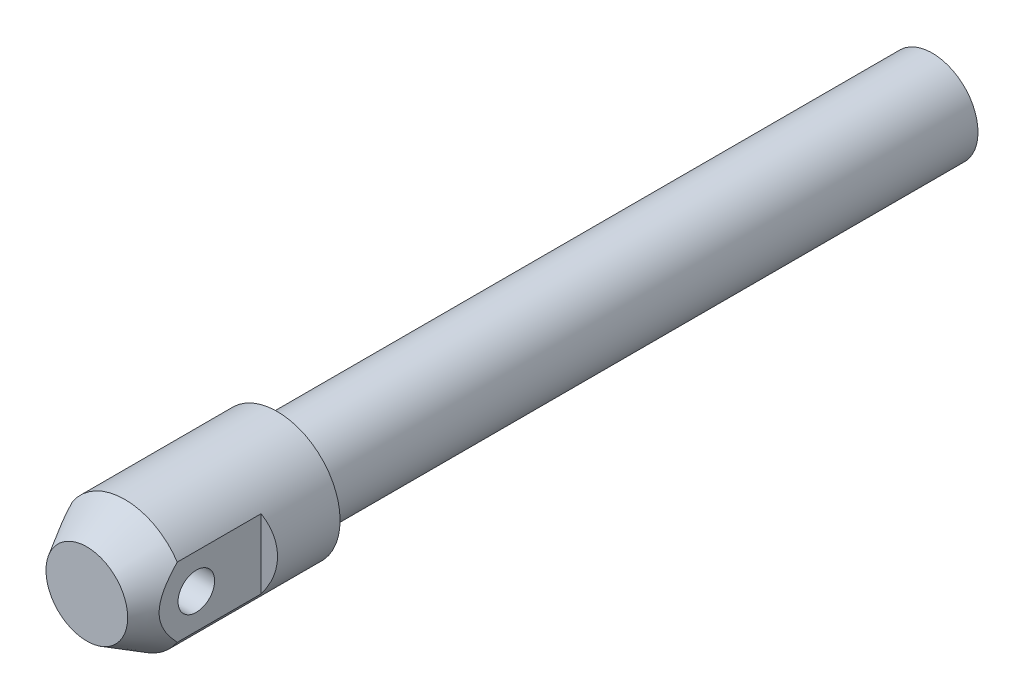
ISO-10303-21;
HEADER;
FILE_DESCRIPTION(('STEP AP214'),'2;1');
FILE_NAME('part.step','',(''),(''),'','','');
FILE_SCHEMA(('AUTOMOTIVE_DESIGN { 1 0 10303 214 1 1 1 1 }'));
ENDSEC;
DATA;
#1=APPLICATION_CONTEXT('core data for automotive mechanical design processes');
#2=APPLICATION_PROTOCOL_DEFINITION('international standard','automotive_design',2000,#1);
#3=PRODUCT_CONTEXT('',#1,'mechanical');
#4=PRODUCT('Part','Part','',(#3));
#5=PRODUCT_RELATED_PRODUCT_CATEGORY('part','',(#4));
#6=PRODUCT_DEFINITION_FORMATION('','',#4);
#7=PRODUCT_DEFINITION_CONTEXT('part definition',#1,'design');
#8=PRODUCT_DEFINITION('design','',#6,#7);
#9=PRODUCT_DEFINITION_SHAPE('','',#8);
#10=(LENGTH_UNIT() NAMED_UNIT(*) SI_UNIT(.MILLI.,.METRE.));
#11=(NAMED_UNIT(*) PLANE_ANGLE_UNIT() SI_UNIT($,.RADIAN.));
#12=(NAMED_UNIT(*) SI_UNIT($,.STERADIAN.) SOLID_ANGLE_UNIT());
#13=UNCERTAINTY_MEASURE_WITH_UNIT(LENGTH_MEASURE(1.E-05),#10,'distance_accuracy_value','');
#14=(GEOMETRIC_REPRESENTATION_CONTEXT(3) GLOBAL_UNCERTAINTY_ASSIGNED_CONTEXT((#13)) GLOBAL_UNIT_ASSIGNED_CONTEXT((#10,
#11,#12)) REPRESENTATION_CONTEXT('',''));
#15=CARTESIAN_POINT('',(0.,0.,0.));
#16=DIRECTION('',(0.,0.,1.));
#17=DIRECTION('',(1.,0.,0.));
#18=AXIS2_PLACEMENT_3D('',#15,#16,#17);
#19=CARTESIAN_POINT('',(0.,0.,20.));
#20=DIRECTION('',(0.,0.,1.));
#21=DIRECTION('',(1.,0.,0.));
#22=AXIS2_PLACEMENT_3D('',#19,#20,#21);
#23=CYLINDRICAL_SURFACE('',#22,16.5);
#24=CARTESIAN_POINT('',(0.,0.,0.));
#25=DIRECTION('',(0.,0.,1.));
#26=DIRECTION('',(1.,0.,0.));
#27=AXIS2_PLACEMENT_3D('',#24,#25,#26);
#28=CIRCLE('',#27,16.5);
#29=CARTESIAN_POINT('',(16.5,0.,0.));
#30=VERTEX_POINT('',#29);
#31=EDGE_CURVE('E82',#30,#30,#28,.T.);
#32=ORIENTED_EDGE('',*,*,#31,.T.);
#33=EDGE_LOOP('',(#32));
#34=FACE_BOUND('',#33,.T.);
#35=CARTESIAN_POINT('',(0.,0.,40.));
#36=DIRECTION('',(0.,0.,1.));
#37=DIRECTION('',(1.,0.,0.));
#38=AXIS2_PLACEMENT_3D('',#35,#36,#37);
#39=CIRCLE('',#38,16.5);
#40=CARTESIAN_POINT('',(-13.75,-9.12071817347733,40.));
#41=VERTEX_POINT('',#40);
#42=CARTESIAN_POINT('',(13.75,-9.12071817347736,40.));
#43=VERTEX_POINT('',#42);
#44=EDGE_CURVE('E67',#41,#43,#39,.T.);
#45=ORIENTED_EDGE('',*,*,#44,.F.);
#46=DIRECTION('',(0.,0.,1.));
#47=VECTOR('',#46,1.);
#48=CARTESIAN_POINT('',(-13.75,-9.12071817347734,20.));
#49=LINE('',#48,#47);
#50=CARTESIAN_POINT('',(-13.75,-9.12071817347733,18.));
#51=VERTEX_POINT('',#50);
#52=EDGE_CURVE('E30',#41,#51,#49,.F.);
#53=ORIENTED_EDGE('',*,*,#52,.T.);
#54=CARTESIAN_POINT('',(0.,0.,25.9385662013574));
#55=DIRECTION('',(0.5,0.,-0.866025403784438));
#56=DIRECTION('',(0.866025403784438,0.,0.5));
#57=AXIS2_PLACEMENT_3D('',#54,#55,#56);
#58=ELLIPSE('',#57,19.0525588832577,16.5);
#59=CARTESIAN_POINT('',(-13.75,9.12071817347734,18.));
#60=VERTEX_POINT('',#59);
#61=EDGE_CURVE('E9',#60,#51,#58,.F.);
#62=ORIENTED_EDGE('',*,*,#61,.F.);
#63=DIRECTION('',(0.,0.,1.));
#64=VECTOR('',#63,1.);
#65=CARTESIAN_POINT('',(-13.75,9.12071817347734,20.));
#66=LINE('',#65,#64);
#67=CARTESIAN_POINT('',(-13.75,9.12071817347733,40.));
#68=VERTEX_POINT('',#67);
#69=EDGE_CURVE('E63',#60,#68,#66,.T.);
#70=ORIENTED_EDGE('',*,*,#69,.T.);
#71=CARTESIAN_POINT('',(13.75,9.12071817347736,40.));
#72=VERTEX_POINT('',#71);
#73=EDGE_CURVE('E79',#72,#68,#39,.T.);
#74=ORIENTED_EDGE('',*,*,#73,.F.);
#75=DIRECTION('',(0.,0.,1.));
#76=VECTOR('',#75,1.);
#77=CARTESIAN_POINT('',(13.75,9.12071817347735,20.));
#78=LINE('',#77,#76);
#79=CARTESIAN_POINT('',(13.75,9.12071817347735,18.));
#80=VERTEX_POINT('',#79);
#81=EDGE_CURVE('E38',#80,#72,#78,.T.);
#82=ORIENTED_EDGE('',*,*,#81,.F.);
#83=CARTESIAN_POINT('',(0.,0.,25.9385662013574));
#84=DIRECTION('',(0.5,0.,0.866025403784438));
#85=DIRECTION('',(-0.866025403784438,0.,0.5));
#86=AXIS2_PLACEMENT_3D('',#83,#84,#85);
#87=ELLIPSE('',#86,19.0525588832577,16.5);
#88=CARTESIAN_POINT('',(13.75,-9.12071817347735,18.));
#89=VERTEX_POINT('',#88);
#90=EDGE_CURVE('E99',#80,#89,#87,.F.);
#91=ORIENTED_EDGE('',*,*,#90,.T.);
#92=DIRECTION('',(0.,0.,1.));
#93=VECTOR('',#92,1.);
#94=CARTESIAN_POINT('',(13.75,-9.12071817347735,20.));
#95=LINE('',#94,#93);
#96=EDGE_CURVE('E74',#43,#89,#95,.F.);
#97=ORIENTED_EDGE('',*,*,#96,.F.);
#98=EDGE_LOOP('',(#45,#53,#62,#70,#74,#82,#91,#97));
#99=FACE_BOUND('',#98,.T.);
#100=ADVANCED_FACE('F14',(#34,#99),#23,.T.);
#101=CARTESIAN_POINT('',(0.,0.,50.));
#102=DIRECTION('',(0.,0.,-1.));
#103=DIRECTION('',(-1.,0.,0.));
#104=AXIS2_PLACEMENT_3D('',#101,#102,#103);
#105=CONICAL_SURFACE('',#104,10.7264973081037,0.523598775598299);
#106=CARTESIAN_POINT('',(0.,0.,50.));
#107=DIRECTION('',(0.,0.,1.));
#108=DIRECTION('',(1.,0.,0.));
#109=AXIS2_PLACEMENT_3D('',#106,#107,#108);
#110=CIRCLE('',#109,10.7264973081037);
#111=CARTESIAN_POINT('',(10.7264973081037,0.,50.));
#112=VERTEX_POINT('',#111);
#113=EDGE_CURVE('E76',#112,#112,#110,.T.);
#114=ORIENTED_EDGE('',*,*,#113,.F.);
#115=EDGE_LOOP('',(#114));
#116=FACE_BOUND('',#115,.T.);
#117=ORIENTED_EDGE('',*,*,#73,.T.);
#118=CARTESIAN_POINT('',(-13.75,-22.2908760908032,23.215450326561));
#119=CARTESIAN_POINT('',(-13.75,-22.0557406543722,23.5620720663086));
#120=CARTESIAN_POINT('',(-13.75,-21.8199072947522,23.9082200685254));
#121=CARTESIAN_POINT('',(-13.75,-21.3467083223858,24.5994700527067));
#122=CARTESIAN_POINT('',(-13.75,-21.1093427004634,24.9445720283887));
#123=CARTESIAN_POINT('',(-13.75,-20.3946726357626,25.9782625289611));
#124=CARTESIAN_POINT('',(-13.75,-19.9148683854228,26.6651272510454));
#125=CARTESIAN_POINT('',(-13.75,-18.9436306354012,28.0383267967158));
#126=CARTESIAN_POINT('',(-13.75,-18.4521369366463,28.7246190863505));
#127=CARTESIAN_POINT('',(-13.75,-17.4592874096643,30.0899583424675));
#128=CARTESIAN_POINT('',(-13.75,-16.9579325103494,30.7690059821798));
#129=CARTESIAN_POINT('',(-13.75,-16.1568934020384,31.8335366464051));
#130=CARTESIAN_POINT('',(-13.75,-15.8612940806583,32.2220942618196));
#131=CARTESIAN_POINT('',(-13.75,-15.2653977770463,32.9955876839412));
#132=CARTESIAN_POINT('',(-13.75,-14.9651008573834,33.3805235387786));
#133=CARTESIAN_POINT('',(-13.75,-14.3590041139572,34.1462734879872));
#134=CARTESIAN_POINT('',(-13.75,-14.0532023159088,34.5270860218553));
#135=CARTESIAN_POINT('',(-13.75,-13.435365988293,35.2836221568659));
#136=CARTESIAN_POINT('',(-13.75,-13.123331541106,35.6593458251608));
#137=CARTESIAN_POINT('',(-13.75,-12.4931356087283,36.4033220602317));
#138=CARTESIAN_POINT('',(-13.75,-12.1750000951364,36.7715965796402));
#139=CARTESIAN_POINT('',(-13.75,-11.5302619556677,37.5007213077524));
#140=CARTESIAN_POINT('',(-13.75,-11.2036588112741,37.8615710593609));
#141=CARTESIAN_POINT('',(-13.75,-10.5406962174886,38.5737791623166));
#142=CARTESIAN_POINT('',(-13.75,-10.2043433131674,38.9251435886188));
#143=CARTESIAN_POINT('',(-13.75,-9.51984349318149,39.616147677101));
#144=CARTESIAN_POINT('',(-13.75,-9.17169871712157,39.9557894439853));
#145=CARTESIAN_POINT('',(-13.75,-8.59989908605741,40.4903555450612));
#146=CARTESIAN_POINT('',(-13.75,-8.38068348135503,40.6900295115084));
#147=CARTESIAN_POINT('',(-13.75,-7.93635754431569,41.0827441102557));
#148=CARTESIAN_POINT('',(-13.75,-7.71124703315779,41.2757845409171));
#149=CARTESIAN_POINT('',(-13.75,-7.25417670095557,41.6542080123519));
#150=CARTESIAN_POINT('',(-13.75,-7.02220861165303,41.8395811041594));
#151=CARTESIAN_POINT('',(-13.75,-6.55098002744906,42.2008257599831));
#152=CARTESIAN_POINT('',(-13.75,-6.31171977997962,42.3766976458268));
#153=CARTESIAN_POINT('',(-13.75,-5.83073947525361,42.7130631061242));
#154=CARTESIAN_POINT('',(-13.75,-5.58920412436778,42.8738181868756));
#155=CARTESIAN_POINT('',(-13.75,-5.09787025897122,43.1820906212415));
#156=CARTESIAN_POINT('',(-13.75,-4.84807053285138,43.3296060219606));
#157=CARTESIAN_POINT('',(-13.75,-4.08642165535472,43.7475970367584));
#158=CARTESIAN_POINT('',(-13.75,-3.56081533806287,43.99461076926));
#159=CARTESIAN_POINT('',(-13.75,-2.78827593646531,44.281531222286));
#160=CARTESIAN_POINT('',(-13.75,-2.55498917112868,44.3588307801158));
#161=CARTESIAN_POINT('',(-13.75,-2.0829743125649,44.4947868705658));
#162=CARTESIAN_POINT('',(-13.75,-1.8442466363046,44.5534448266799));
#163=CARTESIAN_POINT('',(-13.75,-1.36288805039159,44.6500126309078));
#164=CARTESIAN_POINT('',(-13.75,-1.12026201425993,44.6879465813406));
#165=CARTESIAN_POINT('',(-13.75,-0.632546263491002,44.7416774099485));
#166=CARTESIAN_POINT('',(-13.75,-0.387456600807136,44.757474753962));
#167=CARTESIAN_POINT('',(-13.75,0.103935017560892,44.7662733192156));
#168=CARTESIAN_POINT('',(-13.75,0.35023832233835,44.7592001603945));
#169=CARTESIAN_POINT('',(-13.75,0.841126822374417,44.7224022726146));
#170=CARTESIAN_POINT('',(-13.75,1.08571201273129,44.6926774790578));
#171=CARTESIAN_POINT('',(-13.75,1.57163629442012,44.6117390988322));
#172=CARTESIAN_POINT('',(-13.75,1.81297006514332,44.5604938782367));
#173=CARTESIAN_POINT('',(-13.75,2.29060337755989,44.4384042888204));
#174=CARTESIAN_POINT('',(-13.75,2.52690212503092,44.3675568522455));
#175=CARTESIAN_POINT('',(-13.75,3.08787529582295,44.1763196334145));
#176=CARTESIAN_POINT('',(-13.75,3.40967131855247,44.047479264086));
#177=CARTESIAN_POINT('',(-13.75,4.04054004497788,43.7617734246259));
#178=CARTESIAN_POINT('',(-13.75,4.34960570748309,43.6048926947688));
#179=CARTESIAN_POINT('',(-13.75,4.95806988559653,43.2671155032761));
#180=CARTESIAN_POINT('',(-13.75,5.25734890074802,43.0860053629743));
#181=CARTESIAN_POINT('',(-13.75,5.69726521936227,42.8007731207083));
#182=CARTESIAN_POINT('',(-13.75,5.84238521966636,42.7034481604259));
#183=CARTESIAN_POINT('',(-13.75,6.12981607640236,42.5047259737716));
#184=CARTESIAN_POINT('',(-13.75,6.27212690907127,42.4033287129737));
#185=CARTESIAN_POINT('',(-13.75,6.63788685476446,42.1355489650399));
#186=CARTESIAN_POINT('',(-13.75,6.85928516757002,41.9663636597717));
#187=CARTESIAN_POINT('',(-13.75,7.29594519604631,41.6202233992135));
#188=CARTESIAN_POINT('',(-13.75,7.51120599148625,41.4432672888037));
#189=CARTESIAN_POINT('',(-13.75,7.93626705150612,41.0827036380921));
#190=CARTESIAN_POINT('',(-13.75,8.14606435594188,40.8990926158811));
#191=CARTESIAN_POINT('',(-13.75,8.56063050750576,40.5262688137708));
#192=CARTESIAN_POINT('',(-13.75,8.76539900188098,40.3370556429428));
#193=CARTESIAN_POINT('',(-13.75,9.3744173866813,39.7608249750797));
#194=CARTESIAN_POINT('',(-13.75,9.77181904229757,39.3665594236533));
#195=CARTESIAN_POINT('',(-13.75,10.551615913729,38.5637922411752));
#196=CARTESIAN_POINT('',(-13.75,10.9340151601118,38.155294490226));
#197=CARTESIAN_POINT('',(-13.75,11.6616342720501,37.3546816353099));
#198=CARTESIAN_POINT('',(-13.75,12.0076380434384,36.9632764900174));
#199=CARTESIAN_POINT('',(-13.75,12.6907197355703,36.1727114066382));
#200=CARTESIAN_POINT('',(-13.75,13.0277968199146,35.7735507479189));
#201=CARTESIAN_POINT('',(-13.75,13.691396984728,34.9725610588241));
#202=CARTESIAN_POINT('',(-13.75,14.0179874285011,34.5707876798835));
#203=CARTESIAN_POINT('',(-13.75,14.6646823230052,33.7622085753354));
#204=CARTESIAN_POINT('',(-13.75,14.9847883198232,33.3554040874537));
#205=CARTESIAN_POINT('',(-13.75,15.3022091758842,32.9465451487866));
#206=B_SPLINE_CURVE_WITH_KNOTS('',3,(#118,#119,#120,#121,#122,#123,#124,#125,#126,#127,#128,
#129,#130,#131,#132,#133,#134,#135,#136,#137,#138,#139,#140,#141,#142,#143,#144,#145,#146,#147,
#148,#149,#150,#151,#152,#153,#154,#155,#156,#157,#158,#159,#160,#161,#162,#163,#164,#165,#166,
#167,#168,#169,#170,#171,#172,#173,#174,#175,#176,#177,#178,#179,#180,#181,#182,#183,#184,#185,
#186,#187,#188,#189,#190,#191,#192,#193,#194,#195,#196,#197,#198,#199,#200,#201,#202,#203,#204,
#205),.UNSPECIFIED.,.F.,.F.,(4,2,2,2,2,2,2,2,2,2,2,2,2,2,2,2,2,2,2,2,2,2,2,2,2,2,2,2,2,2,2,2,2,
2,2,2,2,2,2,2,2,2,2,4),(0.,1.25654818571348,2.51310390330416,5.0266079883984,7.55894561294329,
10.0910458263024,11.5556682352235,13.0202711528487,14.4854102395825,15.9505299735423,
17.4103979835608,18.8703556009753,20.3293548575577,21.7880907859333,22.6775479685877,
23.5670321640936,24.4576364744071,25.3482105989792,26.2181984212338,27.088314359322,
28.8229872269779,29.5596652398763,30.2962869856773,31.0320501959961,31.767797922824,
32.5059408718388,33.2440859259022,33.9833198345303,34.7226694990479,35.7608204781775,
36.7995381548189,37.8481082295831,38.3722560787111,38.8964083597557,39.7321129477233,
40.5679421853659,41.404215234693,42.2405467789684,43.9193811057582,45.5977612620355,
47.164842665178,48.7320703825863,50.2853040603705,51.8381629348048),.UNSPECIFIED.);
#207=EDGE_CURVE('E23',#68,#41,#206,.F.);
#208=ORIENTED_EDGE('',*,*,#207,.T.);
#209=ORIENTED_EDGE('',*,*,#44,.T.);
#210=CARTESIAN_POINT('',(13.75,-22.2908760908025,23.215450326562));
#211=CARTESIAN_POINT('',(13.75,-22.0557406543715,23.5620720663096));
#212=CARTESIAN_POINT('',(13.75,-21.8199072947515,23.9082200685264));
#213=CARTESIAN_POINT('',(13.75,-21.3467083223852,24.5994700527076));
#214=CARTESIAN_POINT('',(13.75,-21.1093427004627,24.9445720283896));
#215=CARTESIAN_POINT('',(13.75,-20.394672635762,25.9782625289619));
#216=CARTESIAN_POINT('',(13.75,-19.9148683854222,26.6651272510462));
#217=CARTESIAN_POINT('',(13.75,-18.9436306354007,28.0383267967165));
#218=CARTESIAN_POINT('',(13.75,-18.4521369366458,28.7246190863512));
#219=CARTESIAN_POINT('',(13.75,-17.4592874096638,30.0899583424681));
#220=CARTESIAN_POINT('',(13.75,-16.957932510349,30.7690059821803));
#221=CARTESIAN_POINT('',(13.75,-16.156893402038,31.8335366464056));
#222=CARTESIAN_POINT('',(13.75,-15.861294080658,32.2220942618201));
#223=CARTESIAN_POINT('',(13.75,-15.2653977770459,32.9955876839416));
#224=CARTESIAN_POINT('',(13.75,-14.9651008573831,33.380523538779));
#225=CARTESIAN_POINT('',(13.75,-14.359004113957,34.1462734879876));
#226=CARTESIAN_POINT('',(13.75,-14.0532023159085,34.5270860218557));
#227=CARTESIAN_POINT('',(13.75,-13.4353659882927,35.2836221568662));
#228=CARTESIAN_POINT('',(13.75,-13.1233315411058,35.6593458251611));
#229=CARTESIAN_POINT('',(13.75,-12.4931356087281,36.403322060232));
#230=CARTESIAN_POINT('',(13.75,-12.1750000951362,36.7715965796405));
#231=CARTESIAN_POINT('',(13.75,-11.5302619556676,37.5007213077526));
#232=CARTESIAN_POINT('',(13.75,-11.203658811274,37.8615710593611));
#233=CARTESIAN_POINT('',(13.75,-10.5406962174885,38.5737791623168));
#234=CARTESIAN_POINT('',(13.75,-10.2043433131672,38.9251435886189));
#235=CARTESIAN_POINT('',(13.75,-9.51984349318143,39.6161476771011));
#236=CARTESIAN_POINT('',(13.75,-9.17169871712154,39.9557894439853));
#237=CARTESIAN_POINT('',(13.75,-8.59989908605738,40.4903555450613));
#238=CARTESIAN_POINT('',(13.75,-8.38068348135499,40.6900295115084));
#239=CARTESIAN_POINT('',(13.75,-7.93635754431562,41.0827441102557));
#240=CARTESIAN_POINT('',(13.75,-7.71124703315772,41.2757845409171));
#241=CARTESIAN_POINT('',(13.75,-7.25417670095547,41.654208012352));
#242=CARTESIAN_POINT('',(13.75,-7.02220861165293,41.8395811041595));
#243=CARTESIAN_POINT('',(13.75,-6.55098002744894,42.2008257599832));
#244=CARTESIAN_POINT('',(13.75,-6.31171977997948,42.3766976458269));
#245=CARTESIAN_POINT('',(13.75,-5.83073947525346,42.7130631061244));
#246=CARTESIAN_POINT('',(13.75,-5.58920412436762,42.8738181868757));
#247=CARTESIAN_POINT('',(13.75,-5.09787025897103,43.1820906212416));
#248=CARTESIAN_POINT('',(13.75,-4.84807053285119,43.3296060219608));
#249=CARTESIAN_POINT('',(13.75,-4.08642165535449,43.7475970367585));
#250=CARTESIAN_POINT('',(13.75,-3.56081533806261,43.9946107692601));
#251=CARTESIAN_POINT('',(13.75,-2.78827593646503,44.2815312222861));
#252=CARTESIAN_POINT('',(13.75,-2.5549891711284,44.3588307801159));
#253=CARTESIAN_POINT('',(13.75,-2.08297431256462,44.4947868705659));
#254=CARTESIAN_POINT('',(13.75,-1.84424663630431,44.5534448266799));
#255=CARTESIAN_POINT('',(13.75,-1.3628880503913,44.6500126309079));
#256=CARTESIAN_POINT('',(13.75,-1.12026201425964,44.6879465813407));
#257=CARTESIAN_POINT('',(13.75,-0.63254626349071,44.7416774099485));
#258=CARTESIAN_POINT('',(13.75,-0.387456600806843,44.757474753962));
#259=CARTESIAN_POINT('',(13.75,0.103935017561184,44.7662733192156));
#260=CARTESIAN_POINT('',(13.75,0.350238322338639,44.7592001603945));
#261=CARTESIAN_POINT('',(13.75,0.841126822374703,44.7224022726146));
#262=CARTESIAN_POINT('',(13.75,1.08571201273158,44.6926774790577));
#263=CARTESIAN_POINT('',(13.75,1.5716362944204,44.6117390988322));
#264=CARTESIAN_POINT('',(13.75,1.81297006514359,44.5604938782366));
#265=CARTESIAN_POINT('',(13.75,2.29060337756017,44.4384042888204));
#266=CARTESIAN_POINT('',(13.75,2.52690212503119,44.3675568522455));
#267=CARTESIAN_POINT('',(13.75,3.08787529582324,44.1763196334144));
#268=CARTESIAN_POINT('',(13.75,3.40967131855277,44.0474792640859));
#269=CARTESIAN_POINT('',(13.75,4.0405400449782,43.7617734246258));
#270=CARTESIAN_POINT('',(13.75,4.34960570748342,43.6048926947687));
#271=CARTESIAN_POINT('',(13.75,4.95806988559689,43.2671155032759));
#272=CARTESIAN_POINT('',(13.75,5.25734890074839,43.086005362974));
#273=CARTESIAN_POINT('',(13.75,5.69726521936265,42.8007731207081));
#274=CARTESIAN_POINT('',(13.75,5.84238521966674,42.7034481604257));
#275=CARTESIAN_POINT('',(13.75,6.12981607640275,42.5047259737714));
#276=CARTESIAN_POINT('',(13.75,6.27212690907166,42.4033287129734));
#277=CARTESIAN_POINT('',(13.75,6.63788685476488,42.1355489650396));
#278=CARTESIAN_POINT('',(13.75,6.85928516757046,41.9663636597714));
#279=CARTESIAN_POINT('',(13.75,7.2959451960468,41.6202233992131));
#280=CARTESIAN_POINT('',(13.75,7.51120599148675,41.4432672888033));
#281=CARTESIAN_POINT('',(13.75,7.93626705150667,41.0827036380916));
#282=CARTESIAN_POINT('',(13.75,8.14606435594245,40.8990926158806));
#283=CARTESIAN_POINT('',(13.75,8.56063050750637,40.5262688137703));
#284=CARTESIAN_POINT('',(13.75,8.76539900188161,40.3370556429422));
#285=CARTESIAN_POINT('',(13.75,9.37441738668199,39.760824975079));
#286=CARTESIAN_POINT('',(13.75,9.7718190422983,39.3665594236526));
#287=CARTESIAN_POINT('',(13.75,10.5516159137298,38.5637922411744));
#288=CARTESIAN_POINT('',(13.75,10.9340151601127,38.1552944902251));
#289=CARTESIAN_POINT('',(13.75,11.661634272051,37.3546816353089));
#290=CARTESIAN_POINT('',(13.75,12.0076380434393,36.9632764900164));
#291=CARTESIAN_POINT('',(13.75,12.6907197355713,36.1727114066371));
#292=CARTESIAN_POINT('',(13.75,13.0277968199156,35.7735507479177));
#293=CARTESIAN_POINT('',(13.75,13.691396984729,34.9725610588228));
#294=CARTESIAN_POINT('',(13.75,14.0179874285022,34.5707876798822));
#295=CARTESIAN_POINT('',(13.75,14.6646823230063,33.762208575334));
#296=CARTESIAN_POINT('',(13.75,14.9847883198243,33.3554040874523));
#297=CARTESIAN_POINT('',(13.75,15.3022091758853,32.9465451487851));
#298=B_SPLINE_CURVE_WITH_KNOTS('',3,(#210,#211,#212,#213,#214,#215,#216,#217,#218,#219,#220,
#221,#222,#223,#224,#225,#226,#227,#228,#229,#230,#231,#232,#233,#234,#235,#236,#237,#238,#239,
#240,#241,#242,#243,#244,#245,#246,#247,#248,#249,#250,#251,#252,#253,#254,#255,#256,#257,#258,
#259,#260,#261,#262,#263,#264,#265,#266,#267,#268,#269,#270,#271,#272,#273,#274,#275,#276,#277,
#278,#279,#280,#281,#282,#283,#284,#285,#286,#287,#288,#289,#290,#291,#292,#293,#294,#295,#296,
#297),.UNSPECIFIED.,.F.,.F.,(4,2,2,2,2,2,2,2,2,2,2,2,2,2,2,2,2,2,2,2,2,2,2,2,2,2,2,2,2,2,2,2,2,
2,2,2,2,2,2,2,2,2,2,4),(0.,1.25654818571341,2.51310390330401,5.0266079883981,7.55894561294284,
10.0910458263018,11.5556682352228,13.0202711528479,14.4854102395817,15.9505299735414,
17.4103979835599,18.8703556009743,20.3293548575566,21.7880907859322,22.6775479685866,
23.5670321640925,24.4576364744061,25.3482105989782,26.2181984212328,27.088314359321,
28.822987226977,29.5596652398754,30.2962869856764,31.0320501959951,31.7677979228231,
32.5059408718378,33.2440859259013,33.9833198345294,34.7226694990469,35.7608204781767,
36.7995381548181,37.8481082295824,38.3722560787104,38.896408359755,39.7321129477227,
40.5679421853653,41.4042152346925,42.2405467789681,43.9193811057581,45.5977612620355,
47.1648426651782,48.7320703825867,50.2853040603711,51.8381629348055),.UNSPECIFIED.);
#299=EDGE_CURVE('E91',#72,#43,#298,.F.);
#300=ORIENTED_EDGE('',*,*,#299,.F.);
#301=EDGE_LOOP('',(#117,#208,#209,#300));
#302=FACE_BOUND('',#301,.T.);
#303=ADVANCED_FACE('F104',(#116,#302),#105,.T.);
#304=CARTESIAN_POINT('',(0.,10.7264973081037,50.));
#305=DIRECTION('',(0.,0.,-1.));
#306=DIRECTION('',(-1.,0.,0.));
#307=AXIS2_PLACEMENT_3D('',#304,#305,#306);
#308=PLANE('',#307);
#309=ORIENTED_EDGE('',*,*,#113,.T.);
#310=EDGE_LOOP('',(#309));
#311=FACE_BOUND('',#310,.T.);
#312=ADVANCED_FACE('F16',(#311),#308,.F.);
#313=CARTESIAN_POINT('',(0.,12.,-172.));
#314=DIRECTION('',(0.,0.,-1.));
#315=DIRECTION('',(-1.,0.,0.));
#316=AXIS2_PLACEMENT_3D('',#313,#314,#315);
#317=PLANE('',#316);
#318=CARTESIAN_POINT('',(0.,0.,-172.));
#319=DIRECTION('',(0.,0.,1.));
#320=DIRECTION('',(1.,0.,0.));
#321=AXIS2_PLACEMENT_3D('',#318,#319,#320);
#322=CIRCLE('',#321,12.);
#323=CARTESIAN_POINT('',(12.,0.,-172.));
#324=VERTEX_POINT('',#323);
#325=EDGE_CURVE('E88',#324,#324,#322,.T.);
#326=ORIENTED_EDGE('',*,*,#325,.F.);
#327=EDGE_LOOP('',(#326));
#328=FACE_BOUND('',#327,.T.);
#329=ADVANCED_FACE('F147',(#328),#317,.T.);
#330=CARTESIAN_POINT('',(0.,0.,20.));
#331=DIRECTION('',(0.,0.,1.));
#332=DIRECTION('',(1.,0.,0.));
#333=AXIS2_PLACEMENT_3D('',#330,#331,#332);
#334=CYLINDRICAL_SURFACE('',#333,12.);
#335=ORIENTED_EDGE('',*,*,#325,.T.);
#336=EDGE_LOOP('',(#335));
#337=FACE_BOUND('',#336,.T.);
#338=CARTESIAN_POINT('',(0.,0.,0.));
#339=DIRECTION('',(0.,0.,1.));
#340=DIRECTION('',(1.,0.,0.));
#341=AXIS2_PLACEMENT_3D('',#338,#339,#340);
#342=CIRCLE('',#341,12.);
#343=CARTESIAN_POINT('',(12.,0.,0.));
#344=VERTEX_POINT('',#343);
#345=EDGE_CURVE('E85',#344,#344,#342,.T.);
#346=ORIENTED_EDGE('',*,*,#345,.F.);
#347=EDGE_LOOP('',(#346));
#348=FACE_BOUND('',#347,.T.);
#349=ADVANCED_FACE('F134',(#337,#348),#334,.T.);
#350=CARTESIAN_POINT('',(0.,12.,0.));
#351=DIRECTION('',(0.,0.,1.));
#352=DIRECTION('',(1.,0.,0.));
#353=AXIS2_PLACEMENT_3D('',#350,#351,#352);
#354=PLANE('',#353);
#355=ORIENTED_EDGE('',*,*,#31,.F.);
#356=EDGE_LOOP('',(#355));
#357=FACE_BOUND('',#356,.T.);
#358=ORIENTED_EDGE('',*,*,#345,.T.);
#359=EDGE_LOOP('',(#358));
#360=FACE_BOUND('',#359,.T.);
#361=ADVANCED_FACE('F125',(#357,#360),#354,.F.);
#362=CARTESIAN_POINT('',(13.75,-15.,18.));
#363=DIRECTION('',(0.5,0.,0.866025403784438));
#364=DIRECTION('',(0.866025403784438,0.,-0.5));
#365=AXIS2_PLACEMENT_3D('',#362,#363,#364);
#366=PLANE('',#365);
#367=DIRECTION('',(0.,1.,0.));
#368=VECTOR('',#367,1.);
#369=CARTESIAN_POINT('',(13.75,-15.,18.));
#370=LINE('',#369,#368);
#371=EDGE_CURVE('E68',#89,#80,#370,.T.);
#372=ORIENTED_EDGE('',*,*,#371,.F.);
#373=ORIENTED_EDGE('',*,*,#90,.F.);
#374=EDGE_LOOP('',(#372,#373));
#375=FACE_BOUND('',#374,.T.);
#376=ADVANCED_FACE('F123',(#375),#366,.T.);
#377=CARTESIAN_POINT('',(13.75,-15.,18.));
#378=DIRECTION('',(-1.,0.,0.));
#379=DIRECTION('',(0.,0.,1.));
#380=AXIS2_PLACEMENT_3D('',#377,#378,#379);
#381=PLANE('',#380);
#382=CARTESIAN_POINT('',(13.75,0.,35.));
#383=DIRECTION('',(1.,0.,0.));
#384=DIRECTION('',(0.,0.,-1.));
#385=AXIS2_PLACEMENT_3D('',#382,#383,#384);
#386=CIRCLE('',#385,4.8);
#387=CARTESIAN_POINT('',(13.75,0.,30.2));
#388=VERTEX_POINT('',#387);
#389=EDGE_CURVE('E233',#388,#388,#386,.T.);
#390=ORIENTED_EDGE('',*,*,#389,.F.);
#391=EDGE_LOOP('',(#390));
#392=FACE_BOUND('',#391,.T.);
#393=ORIENTED_EDGE('',*,*,#96,.T.);
#394=ORIENTED_EDGE('',*,*,#371,.T.);
#395=ORIENTED_EDGE('',*,*,#81,.T.);
#396=ORIENTED_EDGE('',*,*,#299,.T.);
#397=EDGE_LOOP('',(#393,#394,#395,#396));
#398=FACE_BOUND('',#397,.T.);
#399=ADVANCED_FACE('F101',(#392,#398),#381,.F.);
#400=CARTESIAN_POINT('',(-13.75,-15.,18.));
#401=DIRECTION('',(-1.,0.,0.));
#402=DIRECTION('',(0.,0.,1.));
#403=AXIS2_PLACEMENT_3D('',#400,#401,#402);
#404=PLANE('',#403);
#405=CARTESIAN_POINT('',(-13.75,0.,35.));
#406=DIRECTION('',(-1.,0.,0.));
#407=DIRECTION('',(0.,0.,1.));
#408=AXIS2_PLACEMENT_3D('',#405,#406,#407);
#409=CIRCLE('',#408,4.8);
#410=CARTESIAN_POINT('',(-13.75,0.,39.8));
#411=VERTEX_POINT('',#410);
#412=EDGE_CURVE('E18',#411,#411,#409,.T.);
#413=ORIENTED_EDGE('',*,*,#412,.F.);
#414=EDGE_LOOP('',(#413));
#415=FACE_BOUND('',#414,.T.);
#416=ORIENTED_EDGE('',*,*,#207,.F.);
#417=ORIENTED_EDGE('',*,*,#69,.F.);
#418=DIRECTION('',(0.,1.,0.));
#419=VECTOR('',#418,1.);
#420=CARTESIAN_POINT('',(-13.75,-15.,18.));
#421=LINE('',#420,#419);
#422=EDGE_CURVE('E59',#51,#60,#421,.T.);
#423=ORIENTED_EDGE('',*,*,#422,.F.);
#424=ORIENTED_EDGE('',*,*,#52,.F.);
#425=EDGE_LOOP('',(#416,#417,#423,#424));
#426=FACE_BOUND('',#425,.T.);
#427=ADVANCED_FACE('F62',(#415,#426),#404,.T.);
#428=CARTESIAN_POINT('',(-13.75,-15.,18.));
#429=DIRECTION('',(0.5,0.,-0.866025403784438));
#430=DIRECTION('',(-0.866025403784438,0.,-0.5));
#431=AXIS2_PLACEMENT_3D('',#428,#429,#430);
#432=PLANE('',#431);
#433=ORIENTED_EDGE('',*,*,#61,.T.);
#434=ORIENTED_EDGE('',*,*,#422,.T.);
#435=EDGE_LOOP('',(#433,#434));
#436=FACE_BOUND('',#435,.T.);
#437=ADVANCED_FACE('F58',(#436),#432,.F.);
#438=CARTESIAN_POINT('',(-16.5,0.,35.));
#439=DIRECTION('',(1.,0.,0.));
#440=DIRECTION('',(0.,0.,-1.));
#441=AXIS2_PLACEMENT_3D('',#438,#439,#440);
#442=CYLINDRICAL_SURFACE('',#441,4.8);
#443=ORIENTED_EDGE('',*,*,#412,.T.);
#444=EDGE_LOOP('',(#443));
#445=FACE_BOUND('',#444,.T.);
#446=ORIENTED_EDGE('',*,*,#389,.T.);
#447=EDGE_LOOP('',(#446));
#448=FACE_BOUND('',#447,.T.);
#449=ADVANCED_FACE('F121',(#445,#448),#442,.F.);
#450=CLOSED_SHELL('',(#100,#303,#312,#329,#349,#361,#376,#399,#427,#437,#449));
#451=MANIFOLD_SOLID_BREP('B1',#450);
#452=ADVANCED_BREP_SHAPE_REPRESENTATION('',(#18,#451),#14);
#453=SHAPE_DEFINITION_REPRESENTATION(#9,#452);
ENDSEC;
END-ISO-10303-21;
